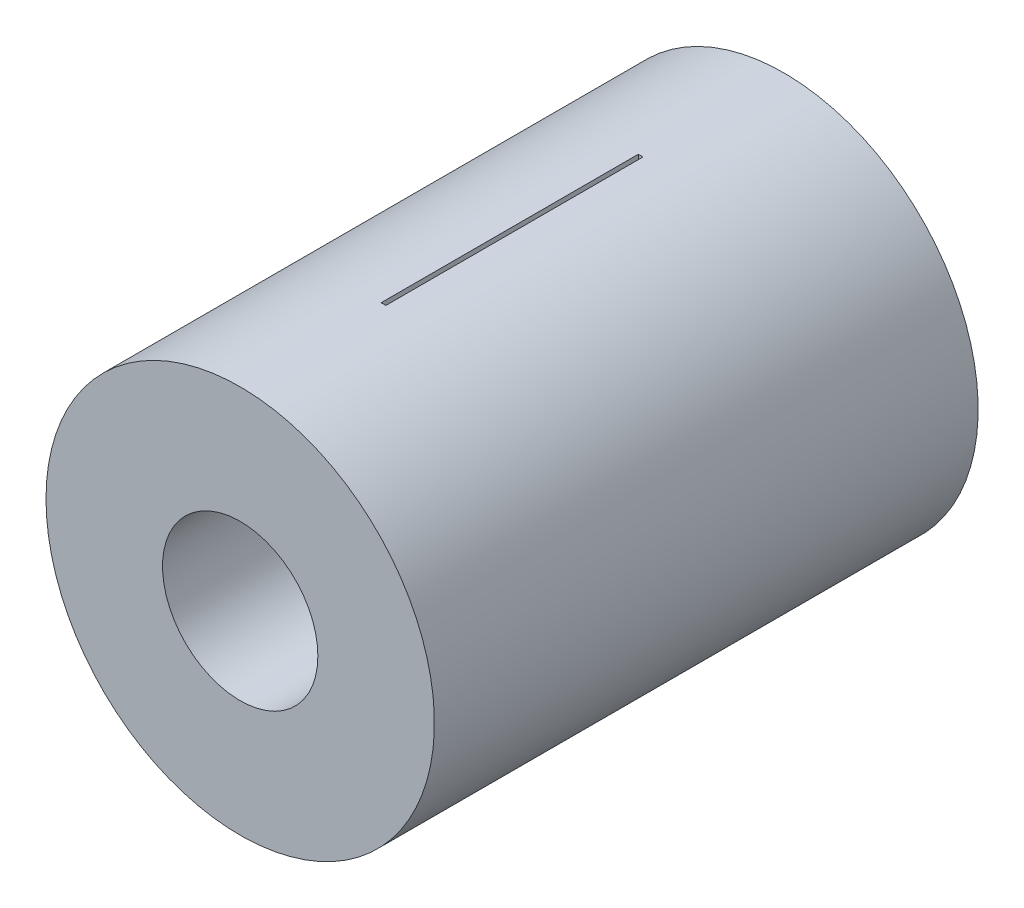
ISO-10303-21;
HEADER;
FILE_DESCRIPTION(('STEP AP214'),'2;1');
FILE_NAME('part.step','',(''),(''),'','','');
FILE_SCHEMA(('AUTOMOTIVE_DESIGN { 1 0 10303 214 1 1 1 1 }'));
ENDSEC;
DATA;
#1=APPLICATION_CONTEXT('core data for automotive mechanical design processes');
#2=APPLICATION_PROTOCOL_DEFINITION('international standard','automotive_design',2000,#1);
#3=PRODUCT_CONTEXT('',#1,'mechanical');
#4=PRODUCT('Part','Part','',(#3));
#5=PRODUCT_RELATED_PRODUCT_CATEGORY('part','',(#4));
#6=PRODUCT_DEFINITION_FORMATION('','',#4);
#7=PRODUCT_DEFINITION_CONTEXT('part definition',#1,'design');
#8=PRODUCT_DEFINITION('design','',#6,#7);
#9=PRODUCT_DEFINITION_SHAPE('','',#8);
#10=(LENGTH_UNIT() NAMED_UNIT(*) SI_UNIT(.MILLI.,.METRE.));
#11=(NAMED_UNIT(*) PLANE_ANGLE_UNIT() SI_UNIT($,.RADIAN.));
#12=(NAMED_UNIT(*) SI_UNIT($,.STERADIAN.) SOLID_ANGLE_UNIT());
#13=UNCERTAINTY_MEASURE_WITH_UNIT(LENGTH_MEASURE(1.E-05),#10,'distance_accuracy_value','');
#14=(GEOMETRIC_REPRESENTATION_CONTEXT(3) GLOBAL_UNCERTAINTY_ASSIGNED_CONTEXT((#13)) GLOBAL_UNIT_ASSIGNED_CONTEXT((#10,
#11,#12)) REPRESENTATION_CONTEXT('',''));
#15=CARTESIAN_POINT('',(0.,0.,0.));
#16=DIRECTION('',(0.,0.,1.));
#17=DIRECTION('',(1.,0.,0.));
#18=AXIS2_PLACEMENT_3D('',#15,#16,#17);
#19=CARTESIAN_POINT('',(0.,0.,22.));
#20=DIRECTION('',(0.,0.,1.));
#21=DIRECTION('',(1.,0.,0.));
#22=AXIS2_PLACEMENT_3D('',#19,#20,#21);
#23=PLANE('',#22);
#24=DIRECTION('',(0.,1.,0.));
#25=VECTOR('',#24,1.);
#26=CARTESIAN_POINT('',(-0.182364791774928,0.,22.));
#27=LINE('',#26,#25);
#28=CARTESIAN_POINT('',(-0.182364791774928,-5.99722794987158,22.));
#29=VERTEX_POINT('',#28);
#30=CARTESIAN_POINT('',(-0.182364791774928,-4.99667320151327,22.));
#31=VERTEX_POINT('',#30);
#32=EDGE_CURVE('E112',#29,#31,#27,.T.);
#33=ORIENTED_EDGE('',*,*,#32,.T.);
#34=CARTESIAN_POINT('',(0.,0.,22.));
#35=DIRECTION('',(0.,0.,-1.));
#36=DIRECTION('',(-1.,0.,0.));
#37=AXIS2_PLACEMENT_3D('',#34,#35,#36);
#38=CIRCLE('',#37,5.);
#39=CARTESIAN_POINT('',(-0.182364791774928,4.99667320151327,22.));
#40=VERTEX_POINT('',#39);
#41=EDGE_CURVE('E131',#31,#40,#38,.T.);
#42=ORIENTED_EDGE('',*,*,#41,.T.);
#43=DIRECTION('',(0.,1.,0.));
#44=VECTOR('',#43,1.);
#45=CARTESIAN_POINT('',(-0.182364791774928,0.,22.));
#46=LINE('',#45,#44);
#47=CARTESIAN_POINT('',(-0.182364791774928,5.99722794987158,22.));
#48=VERTEX_POINT('',#47);
#49=EDGE_CURVE('E115',#40,#48,#46,.T.);
#50=ORIENTED_EDGE('',*,*,#49,.T.);
#51=CARTESIAN_POINT('',(0.,0.,22.));
#52=DIRECTION('',(0.,0.,1.));
#53=DIRECTION('',(1.,0.,0.));
#54=AXIS2_PLACEMENT_3D('',#51,#52,#53);
#55=CIRCLE('',#54,6.);
#56=EDGE_CURVE('E137',#48,#29,#55,.T.);
#57=ORIENTED_EDGE('',*,*,#56,.T.);
#58=EDGE_LOOP('',(#33,#42,#50,#57));
#59=FACE_BOUND('',#58,.T.);
#60=ADVANCED_FACE('F17',(#59),#23,.T.);
#61=CARTESIAN_POINT('',(0.,0.,22.));
#62=DIRECTION('',(0.,0.,1.));
#63=DIRECTION('',(1.,0.,0.));
#64=AXIS2_PLACEMENT_3D('',#61,#62,#63);
#65=PLANE('',#64);
#66=CARTESIAN_POINT('',(0.,0.,22.));
#67=DIRECTION('',(0.,0.,1.));
#68=DIRECTION('',(1.,0.,0.));
#69=AXIS2_PLACEMENT_3D('',#66,#67,#68);
#70=CIRCLE('',#69,6.);
#71=CARTESIAN_POINT('',(0.182364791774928,-5.99722794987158,22.));
#72=VERTEX_POINT('',#71);
#73=CARTESIAN_POINT('',(0.182364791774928,5.99722794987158,22.));
#74=VERTEX_POINT('',#73);
#75=EDGE_CURVE('E140',#72,#74,#70,.T.);
#76=ORIENTED_EDGE('',*,*,#75,.T.);
#77=DIRECTION('',(0.,1.,0.));
#78=VECTOR('',#77,1.);
#79=CARTESIAN_POINT('',(0.182364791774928,0.,22.));
#80=LINE('',#79,#78);
#81=CARTESIAN_POINT('',(0.182364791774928,4.99667320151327,22.));
#82=VERTEX_POINT('',#81);
#83=EDGE_CURVE('E68',#74,#82,#80,.F.);
#84=ORIENTED_EDGE('',*,*,#83,.T.);
#85=CARTESIAN_POINT('',(0.,0.,22.));
#86=DIRECTION('',(0.,0.,-1.));
#87=DIRECTION('',(-1.,0.,0.));
#88=AXIS2_PLACEMENT_3D('',#85,#86,#87);
#89=CIRCLE('',#88,5.);
#90=CARTESIAN_POINT('',(0.182364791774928,-4.99667320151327,22.));
#91=VERTEX_POINT('',#90);
#92=EDGE_CURVE('E105',#82,#91,#89,.T.);
#93=ORIENTED_EDGE('',*,*,#92,.T.);
#94=DIRECTION('',(0.,1.,0.));
#95=VECTOR('',#94,1.);
#96=CARTESIAN_POINT('',(0.182364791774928,0.,22.));
#97=LINE('',#96,#95);
#98=EDGE_CURVE('E109',#91,#72,#97,.F.);
#99=ORIENTED_EDGE('',*,*,#98,.T.);
#100=EDGE_LOOP('',(#76,#84,#93,#99));
#101=FACE_BOUND('',#100,.T.);
#102=ADVANCED_FACE('F231',(#101),#65,.T.);
#103=CARTESIAN_POINT('',(-0.182364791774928,-15.,30.9309696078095));
#104=DIRECTION('',(0.,0.,1.));
#105=DIRECTION('',(1.,0.,0.));
#106=AXIS2_PLACEMENT_3D('',#103,#104,#105);
#107=PLANE('',#106);
#108=CARTESIAN_POINT('',(0.,0.,30.9309696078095));
#109=DIRECTION('',(0.,0.,1.));
#110=DIRECTION('',(1.,0.,0.));
#111=AXIS2_PLACEMENT_3D('',#108,#109,#110);
#112=CIRCLE('',#111,6.);
#113=CARTESIAN_POINT('',(-0.182364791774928,-5.99722794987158,30.9309696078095));
#114=VERTEX_POINT('',#113);
#115=CARTESIAN_POINT('',(0.182364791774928,-5.99722794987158,30.9309696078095));
#116=VERTEX_POINT('',#115);
#117=EDGE_CURVE('E143',#114,#116,#112,.T.);
#118=ORIENTED_EDGE('',*,*,#117,.T.);
#119=DIRECTION('',(0.,1.,0.));
#120=VECTOR('',#119,1.);
#121=CARTESIAN_POINT('',(0.182364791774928,-15.,30.9309696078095));
#122=LINE('',#121,#120);
#123=CARTESIAN_POINT('',(0.182364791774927,-14.9988913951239,30.9309696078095));
#124=VERTEX_POINT('',#123);
#125=EDGE_CURVE('E62',#116,#124,#122,.F.);
#126=ORIENTED_EDGE('',*,*,#125,.T.);
#127=CARTESIAN_POINT('',(0.,0.,30.9309696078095));
#128=DIRECTION('',(0.,0.,-1.));
#129=DIRECTION('',(-1.,0.,0.));
#130=AXIS2_PLACEMENT_3D('',#127,#128,#129);
#131=CIRCLE('',#130,15.);
#132=CARTESIAN_POINT('',(-0.182364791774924,-14.9988913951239,30.9309696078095));
#133=VERTEX_POINT('',#132);
#134=EDGE_CURVE('E20',#133,#124,#131,.F.);
#135=ORIENTED_EDGE('',*,*,#134,.F.);
#136=DIRECTION('',(0.,1.,0.));
#137=VECTOR('',#136,1.);
#138=CARTESIAN_POINT('',(-0.182364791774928,-15.,30.9309696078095));
#139=LINE('',#138,#137);
#140=EDGE_CURVE('E59',#133,#114,#139,.T.);
#141=ORIENTED_EDGE('',*,*,#140,.T.);
#142=EDGE_LOOP('',(#118,#126,#135,#141));
#143=FACE_BOUND('',#142,.T.);
#144=ADVANCED_FACE('F57',(#143),#107,.F.);
#145=CARTESIAN_POINT('',(-0.182364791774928,-15.,11.0690303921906));
#146=DIRECTION('',(0.,0.,-1.));
#147=DIRECTION('',(-1.,0.,0.));
#148=AXIS2_PLACEMENT_3D('',#145,#146,#147);
#149=PLANE('',#148);
#150=CARTESIAN_POINT('',(0.,0.,11.0690303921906));
#151=DIRECTION('',(0.,0.,-1.));
#152=DIRECTION('',(-1.,0.,0.));
#153=AXIS2_PLACEMENT_3D('',#150,#151,#152);
#154=CIRCLE('',#153,5.);
#155=CARTESIAN_POINT('',(0.182364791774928,-4.99667320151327,11.0690303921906));
#156=VERTEX_POINT('',#155);
#157=CARTESIAN_POINT('',(-0.182364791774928,-4.99667320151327,11.0690303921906));
#158=VERTEX_POINT('',#157);
#159=EDGE_CURVE('E134',#156,#158,#154,.T.);
#160=ORIENTED_EDGE('',*,*,#159,.T.);
#161=DIRECTION('',(0.,1.,0.));
#162=VECTOR('',#161,1.);
#163=CARTESIAN_POINT('',(-0.182364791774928,-15.,11.0690303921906));
#164=LINE('',#163,#162);
#165=CARTESIAN_POINT('',(-0.182364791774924,-14.9988913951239,11.0690303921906));
#166=VERTEX_POINT('',#165);
#167=EDGE_CURVE('E92',#158,#166,#164,.F.);
#168=ORIENTED_EDGE('',*,*,#167,.T.);
#169=CARTESIAN_POINT('',(0.,0.,11.0690303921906));
#170=DIRECTION('',(0.,0.,-1.));
#171=DIRECTION('',(-1.,0.,0.));
#172=AXIS2_PLACEMENT_3D('',#169,#170,#171);
#173=CIRCLE('',#172,15.);
#174=CARTESIAN_POINT('',(0.182364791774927,-14.9988913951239,11.0690303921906));
#175=VERTEX_POINT('',#174);
#176=EDGE_CURVE('E67',#175,#166,#173,.T.);
#177=ORIENTED_EDGE('',*,*,#176,.F.);
#178=DIRECTION('',(0.,1.,0.));
#179=VECTOR('',#178,1.);
#180=CARTESIAN_POINT('',(0.182364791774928,-15.,11.0690303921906));
#181=LINE('',#180,#179);
#182=EDGE_CURVE('E97',#175,#156,#181,.T.);
#183=ORIENTED_EDGE('',*,*,#182,.T.);
#184=EDGE_LOOP('',(#160,#168,#177,#183));
#185=FACE_BOUND('',#184,.T.);
#186=ADVANCED_FACE('F189',(#185),#149,.F.);
#187=CARTESIAN_POINT('',(-0.182364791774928,-15.,30.9309696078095));
#188=DIRECTION('',(0.,0.,1.));
#189=DIRECTION('',(1.,0.,0.));
#190=AXIS2_PLACEMENT_3D('',#187,#188,#189);
#191=PLANE('',#190);
#192=CARTESIAN_POINT('',(0.,0.,30.9309696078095));
#193=DIRECTION('',(0.,0.,1.));
#194=DIRECTION('',(1.,0.,0.));
#195=AXIS2_PLACEMENT_3D('',#192,#193,#194);
#196=CIRCLE('',#195,6.);
#197=CARTESIAN_POINT('',(0.182364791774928,5.99722794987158,30.9309696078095));
#198=VERTEX_POINT('',#197);
#199=CARTESIAN_POINT('',(-0.182364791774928,5.99722794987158,30.9309696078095));
#200=VERTEX_POINT('',#199);
#201=EDGE_CURVE('E145',#198,#200,#196,.T.);
#202=ORIENTED_EDGE('',*,*,#201,.T.);
#203=DIRECTION('',(0.,1.,0.));
#204=VECTOR('',#203,1.);
#205=CARTESIAN_POINT('',(-0.182364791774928,-15.,30.9309696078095));
#206=LINE('',#205,#204);
#207=CARTESIAN_POINT('',(-0.182364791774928,14.9988913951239,30.9309696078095));
#208=VERTEX_POINT('',#207);
#209=EDGE_CURVE('E155',#200,#208,#206,.T.);
#210=ORIENTED_EDGE('',*,*,#209,.T.);
#211=CARTESIAN_POINT('',(0.,0.,30.9309696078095));
#212=DIRECTION('',(0.,0.,-1.));
#213=DIRECTION('',(-1.,0.,0.));
#214=AXIS2_PLACEMENT_3D('',#211,#212,#213);
#215=CIRCLE('',#214,15.);
#216=CARTESIAN_POINT('',(0.182364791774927,14.9988913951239,30.9309696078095));
#217=VERTEX_POINT('',#216);
#218=EDGE_CURVE('E35',#217,#208,#215,.F.);
#219=ORIENTED_EDGE('',*,*,#218,.F.);
#220=DIRECTION('',(0.,1.,0.));
#221=VECTOR('',#220,1.);
#222=CARTESIAN_POINT('',(0.182364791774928,-15.,30.9309696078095));
#223=LINE('',#222,#221);
#224=EDGE_CURVE('E177',#217,#198,#223,.F.);
#225=ORIENTED_EDGE('',*,*,#224,.T.);
#226=EDGE_LOOP('',(#202,#210,#219,#225));
#227=FACE_BOUND('',#226,.T.);
#228=ADVANCED_FACE('F156',(#227),#191,.F.);
#229=CARTESIAN_POINT('',(-0.182364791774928,-15.,11.0690303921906));
#230=DIRECTION('',(0.,0.,-1.));
#231=DIRECTION('',(-1.,0.,0.));
#232=AXIS2_PLACEMENT_3D('',#229,#230,#231);
#233=PLANE('',#232);
#234=CARTESIAN_POINT('',(0.,0.,11.0690303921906));
#235=DIRECTION('',(0.,0.,-1.));
#236=DIRECTION('',(-1.,0.,0.));
#237=AXIS2_PLACEMENT_3D('',#234,#235,#236);
#238=CIRCLE('',#237,5.);
#239=CARTESIAN_POINT('',(-0.182364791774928,4.99667320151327,11.0690303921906));
#240=VERTEX_POINT('',#239);
#241=CARTESIAN_POINT('',(0.182364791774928,4.99667320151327,11.0690303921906));
#242=VERTEX_POINT('',#241);
#243=EDGE_CURVE('E128',#240,#242,#238,.T.);
#244=ORIENTED_EDGE('',*,*,#243,.T.);
#245=DIRECTION('',(0.,1.,0.));
#246=VECTOR('',#245,1.);
#247=CARTESIAN_POINT('',(0.182364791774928,-15.,11.0690303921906));
#248=LINE('',#247,#246);
#249=CARTESIAN_POINT('',(0.182364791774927,14.9988913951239,11.0690303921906));
#250=VERTEX_POINT('',#249);
#251=EDGE_CURVE('E125',#242,#250,#248,.T.);
#252=ORIENTED_EDGE('',*,*,#251,.T.);
#253=CARTESIAN_POINT('',(0.,0.,11.0690303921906));
#254=DIRECTION('',(0.,0.,-1.));
#255=DIRECTION('',(-1.,0.,0.));
#256=AXIS2_PLACEMENT_3D('',#253,#254,#255);
#257=CIRCLE('',#256,15.);
#258=CARTESIAN_POINT('',(-0.182364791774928,14.9988913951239,11.0690303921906));
#259=VERTEX_POINT('',#258);
#260=EDGE_CURVE('E148',#259,#250,#257,.T.);
#261=ORIENTED_EDGE('',*,*,#260,.F.);
#262=DIRECTION('',(0.,1.,0.));
#263=VECTOR('',#262,1.);
#264=CARTESIAN_POINT('',(-0.182364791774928,-15.,11.0690303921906));
#265=LINE('',#264,#263);
#266=EDGE_CURVE('E162',#259,#240,#265,.F.);
#267=ORIENTED_EDGE('',*,*,#266,.T.);
#268=EDGE_LOOP('',(#244,#252,#261,#267));
#269=FACE_BOUND('',#268,.T.);
#270=ADVANCED_FACE('F244',(#269),#233,.F.);
#271=CARTESIAN_POINT('',(0.,0.,22.));
#272=DIRECTION('',(0.,0.,1.));
#273=DIRECTION('',(1.,0.,0.));
#274=AXIS2_PLACEMENT_3D('',#271,#272,#273);
#275=CYLINDRICAL_SURFACE('',#274,6.);
#276=CARTESIAN_POINT('',(0.,0.,42.));
#277=DIRECTION('',(0.,0.,1.));
#278=DIRECTION('',(1.,0.,0.));
#279=AXIS2_PLACEMENT_3D('',#276,#277,#278);
#280=CIRCLE('',#279,6.);
#281=CARTESIAN_POINT('',(6.,0.,42.));
#282=VERTEX_POINT('',#281);
#283=EDGE_CURVE('E122',#282,#282,#280,.F.);
#284=ORIENTED_EDGE('',*,*,#283,.F.);
#285=EDGE_LOOP('',(#284));
#286=FACE_BOUND('',#285,.T.);
#287=ORIENTED_EDGE('',*,*,#56,.F.);
#288=DIRECTION('',(0.,0.,1.));
#289=VECTOR('',#288,1.);
#290=CARTESIAN_POINT('',(-0.182364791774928,5.99722794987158,11.0690303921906));
#291=LINE('',#290,#289);
#292=EDGE_CURVE('E163',#48,#200,#291,.T.);
#293=ORIENTED_EDGE('',*,*,#292,.T.);
#294=ORIENTED_EDGE('',*,*,#201,.F.);
#295=DIRECTION('',(0.,0.,-1.));
#296=VECTOR('',#295,1.);
#297=CARTESIAN_POINT('',(0.182364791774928,5.99722794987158,11.0690303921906));
#298=LINE('',#297,#296);
#299=EDGE_CURVE('E180',#198,#74,#298,.T.);
#300=ORIENTED_EDGE('',*,*,#299,.T.);
#301=ORIENTED_EDGE('',*,*,#75,.F.);
#302=DIRECTION('',(0.,0.,-1.));
#303=VECTOR('',#302,1.);
#304=CARTESIAN_POINT('',(0.182364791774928,-5.99722794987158,11.0690303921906));
#305=LINE('',#304,#303);
#306=EDGE_CURVE('E102',#72,#116,#305,.F.);
#307=ORIENTED_EDGE('',*,*,#306,.T.);
#308=ORIENTED_EDGE('',*,*,#117,.F.);
#309=DIRECTION('',(0.,0.,1.));
#310=VECTOR('',#309,1.);
#311=CARTESIAN_POINT('',(-0.182364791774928,-5.99722794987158,11.0690303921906));
#312=LINE('',#311,#310);
#313=EDGE_CURVE('E78',#114,#29,#312,.F.);
#314=ORIENTED_EDGE('',*,*,#313,.T.);
#315=EDGE_LOOP('',(#287,#293,#294,#300,#301,#307,#308,#314));
#316=FACE_BOUND('',#315,.T.);
#317=ADVANCED_FACE('F234',(#286,#316),#275,.F.);
#318=CARTESIAN_POINT('',(0.,0.,22.));
#319=DIRECTION('',(0.,0.,-1.));
#320=DIRECTION('',(-1.,0.,0.));
#321=AXIS2_PLACEMENT_3D('',#318,#319,#320);
#322=CYLINDRICAL_SURFACE('',#321,5.);
#323=ORIENTED_EDGE('',*,*,#41,.F.);
#324=DIRECTION('',(0.,0.,1.));
#325=VECTOR('',#324,1.);
#326=CARTESIAN_POINT('',(-0.182364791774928,-4.99667320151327,11.0690303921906));
#327=LINE('',#326,#325);
#328=EDGE_CURVE('E96',#31,#158,#327,.F.);
#329=ORIENTED_EDGE('',*,*,#328,.T.);
#330=ORIENTED_EDGE('',*,*,#159,.F.);
#331=DIRECTION('',(0.,0.,-1.));
#332=VECTOR('',#331,1.);
#333=CARTESIAN_POINT('',(0.182364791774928,-4.99667320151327,11.0690303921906));
#334=LINE('',#333,#332);
#335=EDGE_CURVE('E79',#156,#91,#334,.F.);
#336=ORIENTED_EDGE('',*,*,#335,.T.);
#337=ORIENTED_EDGE('',*,*,#92,.F.);
#338=DIRECTION('',(0.,0.,-1.));
#339=VECTOR('',#338,1.);
#340=CARTESIAN_POINT('',(0.182364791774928,4.99667320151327,11.0690303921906));
#341=LINE('',#340,#339);
#342=EDGE_CURVE('E237',#82,#242,#341,.T.);
#343=ORIENTED_EDGE('',*,*,#342,.T.);
#344=ORIENTED_EDGE('',*,*,#243,.F.);
#345=DIRECTION('',(0.,0.,1.));
#346=VECTOR('',#345,1.);
#347=CARTESIAN_POINT('',(-0.182364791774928,4.99667320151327,11.0690303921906));
#348=LINE('',#347,#346);
#349=EDGE_CURVE('E172',#240,#40,#348,.T.);
#350=ORIENTED_EDGE('',*,*,#349,.T.);
#351=EDGE_LOOP('',(#323,#329,#330,#336,#337,#343,#344,#350));
#352=FACE_BOUND('',#351,.T.);
#353=CARTESIAN_POINT('',(0.,0.,0.));
#354=DIRECTION('',(0.,0.,-1.));
#355=DIRECTION('',(-1.,0.,0.));
#356=AXIS2_PLACEMENT_3D('',#353,#354,#355);
#357=CIRCLE('',#356,5.);
#358=CARTESIAN_POINT('',(-5.,0.,0.));
#359=VERTEX_POINT('',#358);
#360=EDGE_CURVE('E89',#359,#359,#357,.T.);
#361=ORIENTED_EDGE('',*,*,#360,.T.);
#362=EDGE_LOOP('',(#361));
#363=FACE_BOUND('',#362,.T.);
#364=ADVANCED_FACE('F227',(#352,#363),#322,.F.);
#365=CARTESIAN_POINT('',(0.182364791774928,-15.,11.0690303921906));
#366=DIRECTION('',(1.,0.,0.));
#367=DIRECTION('',(0.,0.,-1.));
#368=AXIS2_PLACEMENT_3D('',#365,#366,#367);
#369=PLANE('',#368);
#370=ORIENTED_EDGE('',*,*,#335,.F.);
#371=ORIENTED_EDGE('',*,*,#182,.F.);
#372=DIRECTION('',(0.,0.,-1.));
#373=VECTOR('',#372,1.);
#374=CARTESIAN_POINT('',(0.182364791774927,-14.9988913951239,42.));
#375=LINE('',#374,#373);
#376=EDGE_CURVE('E84',#124,#175,#375,.T.);
#377=ORIENTED_EDGE('',*,*,#376,.F.);
#378=ORIENTED_EDGE('',*,*,#125,.F.);
#379=ORIENTED_EDGE('',*,*,#306,.F.);
#380=ORIENTED_EDGE('',*,*,#98,.F.);
#381=EDGE_LOOP('',(#370,#371,#377,#378,#379,#380));
#382=FACE_BOUND('',#381,.T.);
#383=ADVANCED_FACE('F229',(#382),#369,.F.);
#384=CARTESIAN_POINT('',(-0.182364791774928,-15.,11.0690303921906));
#385=DIRECTION('',(-1.,0.,0.));
#386=DIRECTION('',(0.,0.,1.));
#387=AXIS2_PLACEMENT_3D('',#384,#385,#386);
#388=PLANE('',#387);
#389=ORIENTED_EDGE('',*,*,#328,.F.);
#390=ORIENTED_EDGE('',*,*,#32,.F.);
#391=ORIENTED_EDGE('',*,*,#313,.F.);
#392=ORIENTED_EDGE('',*,*,#140,.F.);
#393=DIRECTION('',(0.,0.,-1.));
#394=VECTOR('',#393,1.);
#395=CARTESIAN_POINT('',(-0.182364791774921,-14.9988913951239,42.));
#396=LINE('',#395,#394);
#397=EDGE_CURVE('E75',#166,#133,#396,.F.);
#398=ORIENTED_EDGE('',*,*,#397,.F.);
#399=ORIENTED_EDGE('',*,*,#167,.F.);
#400=EDGE_LOOP('',(#389,#390,#391,#392,#398,#399));
#401=FACE_BOUND('',#400,.T.);
#402=ADVANCED_FACE('F73',(#401),#388,.F.);
#403=CARTESIAN_POINT('',(-0.182364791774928,-15.,11.0690303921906));
#404=DIRECTION('',(-1.,0.,0.));
#405=DIRECTION('',(0.,0.,1.));
#406=AXIS2_PLACEMENT_3D('',#403,#404,#405);
#407=PLANE('',#406);
#408=ORIENTED_EDGE('',*,*,#349,.F.);
#409=ORIENTED_EDGE('',*,*,#266,.F.);
#410=DIRECTION('',(0.,0.,-1.));
#411=VECTOR('',#410,1.);
#412=CARTESIAN_POINT('',(-0.182364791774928,14.9988913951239,42.));
#413=LINE('',#412,#411);
#414=EDGE_CURVE('E83',#208,#259,#413,.T.);
#415=ORIENTED_EDGE('',*,*,#414,.F.);
#416=ORIENTED_EDGE('',*,*,#209,.F.);
#417=ORIENTED_EDGE('',*,*,#292,.F.);
#418=ORIENTED_EDGE('',*,*,#49,.F.);
#419=EDGE_LOOP('',(#408,#409,#415,#416,#417,#418));
#420=FACE_BOUND('',#419,.T.);
#421=ADVANCED_FACE('F167',(#420),#407,.F.);
#422=CARTESIAN_POINT('',(0.182364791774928,-15.,11.0690303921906));
#423=DIRECTION('',(1.,0.,0.));
#424=DIRECTION('',(0.,0.,-1.));
#425=AXIS2_PLACEMENT_3D('',#422,#423,#424);
#426=PLANE('',#425);
#427=ORIENTED_EDGE('',*,*,#342,.F.);
#428=ORIENTED_EDGE('',*,*,#83,.F.);
#429=ORIENTED_EDGE('',*,*,#299,.F.);
#430=ORIENTED_EDGE('',*,*,#224,.F.);
#431=DIRECTION('',(0.,0.,-1.));
#432=VECTOR('',#431,1.);
#433=CARTESIAN_POINT('',(0.182364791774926,14.9988913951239,42.));
#434=LINE('',#433,#432);
#435=EDGE_CURVE('E87',#250,#217,#434,.F.);
#436=ORIENTED_EDGE('',*,*,#435,.F.);
#437=ORIENTED_EDGE('',*,*,#251,.F.);
#438=EDGE_LOOP('',(#427,#428,#429,#430,#436,#437));
#439=FACE_BOUND('',#438,.T.);
#440=ADVANCED_FACE('F246',(#439),#426,.F.);
#441=CARTESIAN_POINT('',(0.,0.,42.));
#442=DIRECTION('',(0.,0.,1.));
#443=DIRECTION('',(1.,0.,0.));
#444=AXIS2_PLACEMENT_3D('',#441,#442,#443);
#445=PLANE('',#444);
#446=CARTESIAN_POINT('',(0.,0.,42.));
#447=DIRECTION('',(0.,0.,-1.));
#448=DIRECTION('',(-1.,0.,0.));
#449=AXIS2_PLACEMENT_3D('',#446,#447,#448);
#450=CIRCLE('',#449,15.);
#451=CARTESIAN_POINT('',(-15.,0.,42.));
#452=VERTEX_POINT('',#451);
#453=EDGE_CURVE('E26',#452,#452,#450,.T.);
#454=ORIENTED_EDGE('',*,*,#453,.F.);
#455=EDGE_LOOP('',(#454));
#456=FACE_BOUND('',#455,.T.);
#457=ORIENTED_EDGE('',*,*,#283,.T.);
#458=EDGE_LOOP('',(#457));
#459=FACE_BOUND('',#458,.T.);
#460=ADVANCED_FACE('F248',(#456,#459),#445,.T.);
#461=CARTESIAN_POINT('',(0.,0.,0.));
#462=DIRECTION('',(0.,0.,1.));
#463=DIRECTION('',(1.,0.,0.));
#464=AXIS2_PLACEMENT_3D('',#461,#462,#463);
#465=PLANE('',#464);
#466=CARTESIAN_POINT('',(0.,0.,0.));
#467=DIRECTION('',(0.,0.,-1.));
#468=DIRECTION('',(-1.,0.,0.));
#469=AXIS2_PLACEMENT_3D('',#466,#467,#468);
#470=CIRCLE('',#469,15.);
#471=CARTESIAN_POINT('',(-15.,0.,0.));
#472=VERTEX_POINT('',#471);
#473=EDGE_CURVE('E11',#472,#472,#470,.F.);
#474=ORIENTED_EDGE('',*,*,#473,.F.);
#475=EDGE_LOOP('',(#474));
#476=FACE_BOUND('',#475,.T.);
#477=ORIENTED_EDGE('',*,*,#360,.F.);
#478=EDGE_LOOP('',(#477));
#479=FACE_BOUND('',#478,.T.);
#480=ADVANCED_FACE('F255',(#476,#479),#465,.F.);
#481=CARTESIAN_POINT('',(0.,0.,42.));
#482=DIRECTION('',(0.,0.,-1.));
#483=DIRECTION('',(-1.,0.,0.));
#484=AXIS2_PLACEMENT_3D('',#481,#482,#483);
#485=CYLINDRICAL_SURFACE('',#484,15.);
#486=ORIENTED_EDGE('',*,*,#473,.T.);
#487=EDGE_LOOP('',(#486));
#488=FACE_BOUND('',#487,.T.);
#489=ORIENTED_EDGE('',*,*,#453,.T.);
#490=EDGE_LOOP('',(#489));
#491=FACE_BOUND('',#490,.T.);
#492=ORIENTED_EDGE('',*,*,#435,.T.);
#493=ORIENTED_EDGE('',*,*,#218,.T.);
#494=ORIENTED_EDGE('',*,*,#414,.T.);
#495=ORIENTED_EDGE('',*,*,#260,.T.);
#496=EDGE_LOOP('',(#492,#493,#494,#495));
#497=FACE_BOUND('',#496,.T.);
#498=ORIENTED_EDGE('',*,*,#397,.T.);
#499=ORIENTED_EDGE('',*,*,#134,.T.);
#500=ORIENTED_EDGE('',*,*,#376,.T.);
#501=ORIENTED_EDGE('',*,*,#176,.T.);
#502=EDGE_LOOP('',(#498,#499,#500,#501));
#503=FACE_BOUND('',#502,.T.);
#504=ADVANCED_FACE('F81',(#488,#491,#497,#503),#485,.T.);
#505=CLOSED_SHELL('',(#60,#102,#144,#186,#228,#270,#317,#364,#383,#402,#421,#440,#460,#480,#504));
#506=MANIFOLD_SOLID_BREP('B1',#505);
#507=ADVANCED_BREP_SHAPE_REPRESENTATION('',(#18,#506),#14);
#508=SHAPE_DEFINITION_REPRESENTATION(#9,#507);
ENDSEC;
END-ISO-10303-21;
